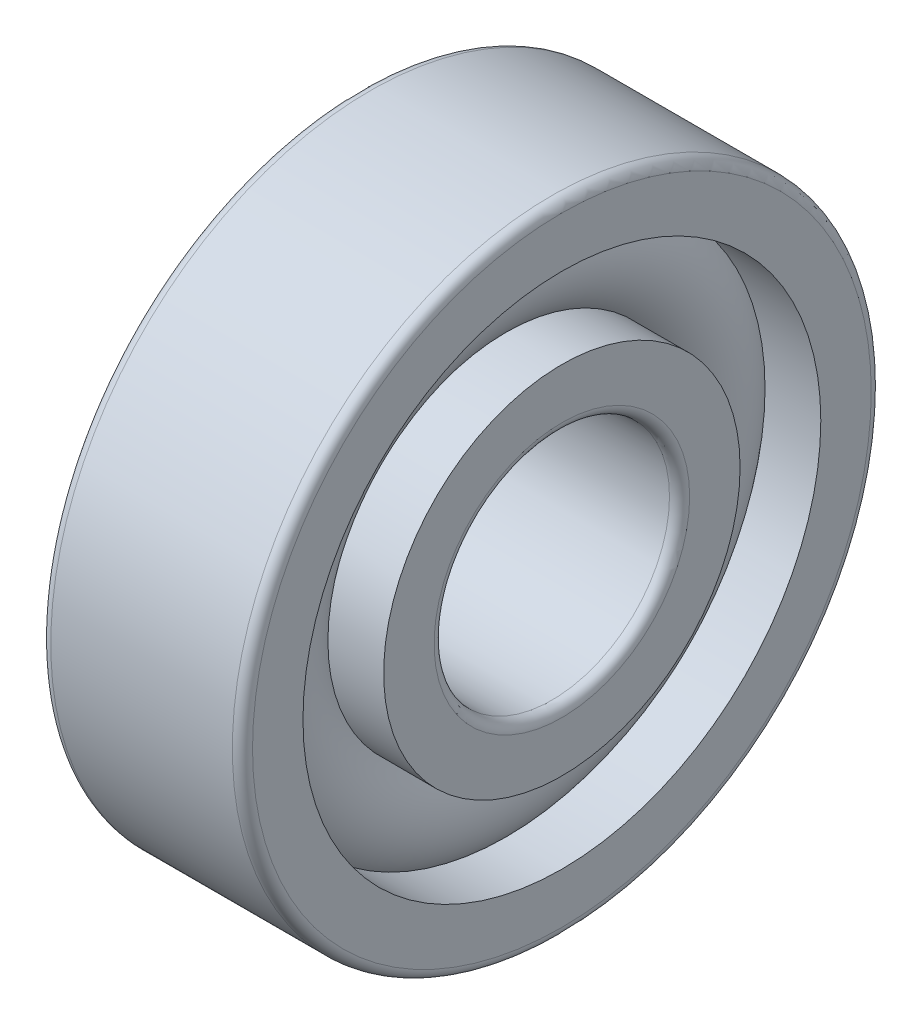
ISO-10303-21;
HEADER;
FILE_DESCRIPTION(('STEP AP214'),'2;1');
FILE_NAME('part.step','',(''),(''),'','','');
FILE_SCHEMA(('AUTOMOTIVE_DESIGN { 1 0 10303 214 1 1 1 1 }'));
ENDSEC;
DATA;
#1=APPLICATION_CONTEXT('core data for automotive mechanical design processes');
#2=APPLICATION_PROTOCOL_DEFINITION('international standard','automotive_design',2000,#1);
#3=PRODUCT_CONTEXT('',#1,'mechanical');
#4=PRODUCT('Part','Part','',(#3));
#5=PRODUCT_RELATED_PRODUCT_CATEGORY('part','',(#4));
#6=PRODUCT_DEFINITION_FORMATION('','',#4);
#7=PRODUCT_DEFINITION_CONTEXT('part definition',#1,'design');
#8=PRODUCT_DEFINITION('design','',#6,#7);
#9=PRODUCT_DEFINITION_SHAPE('','',#8);
#10=(LENGTH_UNIT() NAMED_UNIT(*) SI_UNIT(.MILLI.,.METRE.));
#11=(NAMED_UNIT(*) PLANE_ANGLE_UNIT() SI_UNIT($,.RADIAN.));
#12=(NAMED_UNIT(*) SI_UNIT($,.STERADIAN.) SOLID_ANGLE_UNIT());
#13=UNCERTAINTY_MEASURE_WITH_UNIT(LENGTH_MEASURE(1.E-05),#10,'distance_accuracy_value','');
#14=(GEOMETRIC_REPRESENTATION_CONTEXT(3) GLOBAL_UNCERTAINTY_ASSIGNED_CONTEXT((#13)) GLOBAL_UNIT_ASSIGNED_CONTEXT((#10,
#11,#12)) REPRESENTATION_CONTEXT('',''));
#15=CARTESIAN_POINT('',(0.,0.,0.));
#16=DIRECTION('',(0.,0.,1.));
#17=DIRECTION('',(1.,0.,0.));
#18=AXIS2_PLACEMENT_3D('',#15,#16,#17);
#19=CARTESIAN_POINT('',(0.,0.,0.));
#20=DIRECTION('',(-1.,0.,0.));
#21=DIRECTION('',(0.,0.,1.));
#22=AXIS2_PLACEMENT_3D('',#19,#20,#21);
#23=TOROIDAL_SURFACE('',#22,6.5,1.8);
#24=CARTESIAN_POINT('',(1.34164078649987,0.,0.));
#25=DIRECTION('',(-1.,0.,0.));
#26=DIRECTION('',(0.,0.,1.));
#27=AXIS2_PLACEMENT_3D('',#24,#25,#26);
#28=CIRCLE('',#27,7.70000000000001);
#29=CARTESIAN_POINT('',(1.34164078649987,0.,7.70000000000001));
#30=VERTEX_POINT('',#29);
#31=EDGE_CURVE('E35',#30,#30,#28,.F.);
#32=ORIENTED_EDGE('',*,*,#31,.T.);
#33=EDGE_LOOP('',(#32));
#34=FACE_BOUND('',#33,.T.);
#35=CARTESIAN_POINT('',(1.34164078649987,0.,0.));
#36=DIRECTION('',(-1.,0.,0.));
#37=DIRECTION('',(0.,0.,1.));
#38=AXIS2_PLACEMENT_3D('',#35,#36,#37);
#39=CIRCLE('',#38,5.3);
#40=CARTESIAN_POINT('',(1.34164078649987,0.,5.3));
#41=VERTEX_POINT('',#40);
#42=EDGE_CURVE('E10',#41,#41,#39,.T.);
#43=ORIENTED_EDGE('',*,*,#42,.T.);
#44=EDGE_LOOP('',(#43));
#45=FACE_BOUND('',#44,.T.);
#46=ADVANCED_FACE('F31',(#34,#45),#23,.T.);
#47=CARTESIAN_POINT('',(-20.6375,0.,0.));
#48=DIRECTION('',(1.,0.,0.));
#49=DIRECTION('',(0.,0.,-1.));
#50=AXIS2_PLACEMENT_3D('',#47,#48,#49);
#51=CYLINDRICAL_SURFACE('',#50,5.3);
#52=CARTESIAN_POINT('',(3.,0.,0.));
#53=DIRECTION('',(1.,0.,0.));
#54=DIRECTION('',(0.,0.,-1.));
#55=AXIS2_PLACEMENT_3D('',#52,#53,#54);
#56=CIRCLE('',#55,5.3);
#57=CARTESIAN_POINT('',(3.,0.,-5.3));
#58=VERTEX_POINT('',#57);
#59=EDGE_CURVE('E44',#58,#58,#56,.T.);
#60=ORIENTED_EDGE('',*,*,#59,.F.);
#61=EDGE_LOOP('',(#60));
#62=FACE_BOUND('',#61,.T.);
#63=ORIENTED_EDGE('',*,*,#42,.F.);
#64=EDGE_LOOP('',(#63));
#65=FACE_BOUND('',#64,.T.);
#66=ADVANCED_FACE('F83',(#62,#65),#51,.T.);
#67=CARTESIAN_POINT('',(-20.6375,0.,0.));
#68=DIRECTION('',(1.,0.,0.));
#69=DIRECTION('',(0.,0.,-1.));
#70=AXIS2_PLACEMENT_3D('',#67,#68,#69);
#71=CYLINDRICAL_SURFACE('',#70,5.3);
#72=CARTESIAN_POINT('',(-3.,0.,0.));
#73=DIRECTION('',(1.,0.,0.));
#74=DIRECTION('',(0.,0.,-1.));
#75=AXIS2_PLACEMENT_3D('',#72,#73,#74);
#76=CIRCLE('',#75,5.3);
#77=CARTESIAN_POINT('',(-3.,0.,-5.3));
#78=VERTEX_POINT('',#77);
#79=EDGE_CURVE('E53',#78,#78,#76,.T.);
#80=ORIENTED_EDGE('',*,*,#79,.T.);
#81=EDGE_LOOP('',(#80));
#82=FACE_BOUND('',#81,.T.);
#83=CARTESIAN_POINT('',(-1.34164078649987,0.,0.));
#84=DIRECTION('',(1.,0.,0.));
#85=DIRECTION('',(0.,0.,-1.));
#86=AXIS2_PLACEMENT_3D('',#83,#84,#85);
#87=CIRCLE('',#86,5.3);
#88=CARTESIAN_POINT('',(-1.34164078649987,0.,-5.3));
#89=VERTEX_POINT('',#88);
#90=EDGE_CURVE('E39',#89,#89,#87,.T.);
#91=ORIENTED_EDGE('',*,*,#90,.F.);
#92=EDGE_LOOP('',(#91));
#93=FACE_BOUND('',#92,.T.);
#94=ADVANCED_FACE('F86',(#82,#93),#71,.T.);
#95=CARTESIAN_POINT('',(3.,3.8,0.));
#96=DIRECTION('',(1.,0.,0.));
#97=DIRECTION('',(0.,0.,-1.));
#98=AXIS2_PLACEMENT_3D('',#95,#96,#97);
#99=PLANE('',#98);
#100=ORIENTED_EDGE('',*,*,#59,.T.);
#101=EDGE_LOOP('',(#100));
#102=FACE_BOUND('',#101,.T.);
#103=CARTESIAN_POINT('',(3.,0.,0.));
#104=DIRECTION('',(1.,0.,0.));
#105=DIRECTION('',(0.,0.,-1.));
#106=AXIS2_PLACEMENT_3D('',#103,#104,#105);
#107=CIRCLE('',#106,3.8);
#108=CARTESIAN_POINT('',(3.,0.,-3.8));
#109=VERTEX_POINT('',#108);
#110=EDGE_CURVE('E75',#109,#109,#107,.T.);
#111=ORIENTED_EDGE('',*,*,#110,.F.);
#112=EDGE_LOOP('',(#111));
#113=FACE_BOUND('',#112,.T.);
#114=ADVANCED_FACE('F80',(#102,#113),#99,.T.);
#115=CARTESIAN_POINT('',(2.7,0.,0.));
#116=DIRECTION('',(1.,0.,0.));
#117=DIRECTION('',(0.,0.,-1.));
#118=AXIS2_PLACEMENT_3D('',#115,#116,#117);
#119=TOROIDAL_SURFACE('',#118,3.8,0.3);
#120=ORIENTED_EDGE('',*,*,#110,.T.);
#121=EDGE_LOOP('',(#120));
#122=FACE_BOUND('',#121,.T.);
#123=CARTESIAN_POINT('',(2.7,0.,0.));
#124=DIRECTION('',(1.,0.,0.));
#125=DIRECTION('',(0.,0.,-1.));
#126=AXIS2_PLACEMENT_3D('',#123,#124,#125);
#127=CIRCLE('',#126,3.5);
#128=CARTESIAN_POINT('',(2.7,0.,-3.5));
#129=VERTEX_POINT('',#128);
#130=EDGE_CURVE('E72',#129,#129,#127,.T.);
#131=ORIENTED_EDGE('',*,*,#130,.F.);
#132=EDGE_LOOP('',(#131));
#133=FACE_BOUND('',#132,.T.);
#134=ADVANCED_FACE('F97',(#122,#133),#119,.T.);
#135=CARTESIAN_POINT('',(-20.6375,0.,0.));
#136=DIRECTION('',(1.,0.,0.));
#137=DIRECTION('',(0.,0.,-1.));
#138=AXIS2_PLACEMENT_3D('',#135,#136,#137);
#139=CYLINDRICAL_SURFACE('',#138,3.5);
#140=ORIENTED_EDGE('',*,*,#130,.T.);
#141=EDGE_LOOP('',(#140));
#142=FACE_BOUND('',#141,.T.);
#143=CARTESIAN_POINT('',(-2.7,0.,0.));
#144=DIRECTION('',(1.,0.,0.));
#145=DIRECTION('',(0.,0.,-1.));
#146=AXIS2_PLACEMENT_3D('',#143,#144,#145);
#147=CIRCLE('',#146,3.5);
#148=CARTESIAN_POINT('',(-2.7,0.,-3.5));
#149=VERTEX_POINT('',#148);
#150=EDGE_CURVE('E69',#149,#149,#147,.T.);
#151=ORIENTED_EDGE('',*,*,#150,.F.);
#152=EDGE_LOOP('',(#151));
#153=FACE_BOUND('',#152,.T.);
#154=ADVANCED_FACE('F100',(#142,#153),#139,.F.);
#155=CARTESIAN_POINT('',(-2.7,0.,0.));
#156=DIRECTION('',(1.,0.,0.));
#157=DIRECTION('',(0.,0.,-1.));
#158=AXIS2_PLACEMENT_3D('',#155,#156,#157);
#159=TOROIDAL_SURFACE('',#158,3.8,0.3);
#160=ORIENTED_EDGE('',*,*,#150,.T.);
#161=EDGE_LOOP('',(#160));
#162=FACE_BOUND('',#161,.T.);
#163=CARTESIAN_POINT('',(-3.,0.,0.));
#164=DIRECTION('',(1.,0.,0.));
#165=DIRECTION('',(0.,0.,-1.));
#166=AXIS2_PLACEMENT_3D('',#163,#164,#165);
#167=CIRCLE('',#166,3.8);
#168=CARTESIAN_POINT('',(-3.,0.,-3.8));
#169=VERTEX_POINT('',#168);
#170=EDGE_CURVE('E66',#169,#169,#167,.T.);
#171=ORIENTED_EDGE('',*,*,#170,.F.);
#172=EDGE_LOOP('',(#171));
#173=FACE_BOUND('',#172,.T.);
#174=ADVANCED_FACE('F104',(#162,#173),#159,.T.);
#175=CARTESIAN_POINT('',(-3.,5.3,0.));
#176=DIRECTION('',(-1.,0.,0.));
#177=DIRECTION('',(0.,0.,1.));
#178=AXIS2_PLACEMENT_3D('',#175,#176,#177);
#179=PLANE('',#178);
#180=ORIENTED_EDGE('',*,*,#170,.T.);
#181=EDGE_LOOP('',(#180));
#182=FACE_BOUND('',#181,.T.);
#183=ORIENTED_EDGE('',*,*,#79,.F.);
#184=EDGE_LOOP('',(#183));
#185=FACE_BOUND('',#184,.T.);
#186=ADVANCED_FACE('F108',(#182,#185),#179,.T.);
#187=CARTESIAN_POINT('',(-1.34164078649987,0.,0.));
#188=DIRECTION('',(1.,0.,0.));
#189=DIRECTION('',(0.,0.,-1.));
#190=AXIS2_PLACEMENT_3D('',#187,#188,#189);
#191=CIRCLE('',#190,7.70000000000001);
#192=CARTESIAN_POINT('',(-1.34164078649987,0.,-7.70000000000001));
#193=VERTEX_POINT('',#192);
#194=EDGE_CURVE('E47',#193,#193,#191,.F.);
#195=ORIENTED_EDGE('',*,*,#194,.T.);
#196=EDGE_LOOP('',(#195));
#197=FACE_BOUND('',#196,.T.);
#198=ORIENTED_EDGE('',*,*,#90,.T.);
#199=EDGE_LOOP('',(#198));
#200=FACE_BOUND('',#199,.T.);
#201=ADVANCED_FACE('F33',(#197,#200),#23,.T.);
#202=CARTESIAN_POINT('',(-20.6375,0.,0.));
#203=DIRECTION('',(1.,0.,0.));
#204=DIRECTION('',(0.,0.,-1.));
#205=AXIS2_PLACEMENT_3D('',#202,#203,#204);
#206=CYLINDRICAL_SURFACE('',#205,7.70000000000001);
#207=CARTESIAN_POINT('',(3.,0.,0.));
#208=DIRECTION('',(1.,0.,0.));
#209=DIRECTION('',(0.,0.,-1.));
#210=AXIS2_PLACEMENT_3D('',#207,#208,#209);
#211=CIRCLE('',#210,7.70000000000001);
#212=CARTESIAN_POINT('',(3.,0.,-7.70000000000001));
#213=VERTEX_POINT('',#212);
#214=EDGE_CURVE('E49',#213,#213,#211,.T.);
#215=ORIENTED_EDGE('',*,*,#214,.T.);
#216=EDGE_LOOP('',(#215));
#217=FACE_BOUND('',#216,.T.);
#218=ORIENTED_EDGE('',*,*,#31,.F.);
#219=EDGE_LOOP('',(#218));
#220=FACE_BOUND('',#219,.T.);
#221=ADVANCED_FACE('F113',(#217,#220),#206,.F.);
#222=CARTESIAN_POINT('',(-20.6375,0.,0.));
#223=DIRECTION('',(1.,0.,0.));
#224=DIRECTION('',(0.,0.,-1.));
#225=AXIS2_PLACEMENT_3D('',#222,#223,#224);
#226=CYLINDRICAL_SURFACE('',#225,7.70000000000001);
#227=CARTESIAN_POINT('',(-3.,0.,0.));
#228=DIRECTION('',(1.,0.,0.));
#229=DIRECTION('',(0.,0.,-1.));
#230=AXIS2_PLACEMENT_3D('',#227,#228,#229);
#231=CIRCLE('',#230,7.70000000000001);
#232=CARTESIAN_POINT('',(-3.,0.,-7.70000000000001));
#233=VERTEX_POINT('',#232);
#234=EDGE_CURVE('E144',#233,#233,#231,.T.);
#235=ORIENTED_EDGE('',*,*,#234,.F.);
#236=EDGE_LOOP('',(#235));
#237=FACE_BOUND('',#236,.T.);
#238=ORIENTED_EDGE('',*,*,#194,.F.);
#239=EDGE_LOOP('',(#238));
#240=FACE_BOUND('',#239,.T.);
#241=ADVANCED_FACE('F116',(#237,#240),#226,.F.);
#242=CARTESIAN_POINT('',(3.,9.2,0.));
#243=DIRECTION('',(1.,0.,0.));
#244=DIRECTION('',(0.,0.,-1.));
#245=AXIS2_PLACEMENT_3D('',#242,#243,#244);
#246=PLANE('',#245);
#247=CARTESIAN_POINT('',(3.,0.,0.));
#248=DIRECTION('',(1.,0.,0.));
#249=DIRECTION('',(0.,0.,-1.));
#250=AXIS2_PLACEMENT_3D('',#247,#248,#249);
#251=CIRCLE('',#250,9.2);
#252=CARTESIAN_POINT('',(3.,0.,-9.2));
#253=VERTEX_POINT('',#252);
#254=EDGE_CURVE('E55',#253,#253,#251,.T.);
#255=ORIENTED_EDGE('',*,*,#254,.T.);
#256=EDGE_LOOP('',(#255));
#257=FACE_BOUND('',#256,.T.);
#258=ORIENTED_EDGE('',*,*,#214,.F.);
#259=EDGE_LOOP('',(#258));
#260=FACE_BOUND('',#259,.T.);
#261=ADVANCED_FACE('F117',(#257,#260),#246,.T.);
#262=CARTESIAN_POINT('',(2.7,0.,0.));
#263=DIRECTION('',(1.,0.,0.));
#264=DIRECTION('',(0.,0.,-1.));
#265=AXIS2_PLACEMENT_3D('',#262,#263,#264);
#266=TOROIDAL_SURFACE('',#265,9.2,0.299999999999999);
#267=CARTESIAN_POINT('',(2.7,0.,0.));
#268=DIRECTION('',(1.,0.,0.));
#269=DIRECTION('',(0.,0.,-1.));
#270=AXIS2_PLACEMENT_3D('',#267,#268,#269);
#271=CIRCLE('',#270,9.5);
#272=CARTESIAN_POINT('',(2.7,0.,-9.5));
#273=VERTEX_POINT('',#272);
#274=EDGE_CURVE('E60',#273,#273,#271,.T.);
#275=ORIENTED_EDGE('',*,*,#274,.T.);
#276=EDGE_LOOP('',(#275));
#277=FACE_BOUND('',#276,.T.);
#278=ORIENTED_EDGE('',*,*,#254,.F.);
#279=EDGE_LOOP('',(#278));
#280=FACE_BOUND('',#279,.T.);
#281=ADVANCED_FACE('F120',(#277,#280),#266,.T.);
#282=CARTESIAN_POINT('',(-20.6375,0.,0.));
#283=DIRECTION('',(1.,0.,0.));
#284=DIRECTION('',(0.,0.,-1.));
#285=AXIS2_PLACEMENT_3D('',#282,#283,#284);
#286=CYLINDRICAL_SURFACE('',#285,9.5);
#287=CARTESIAN_POINT('',(-2.7,0.,0.));
#288=DIRECTION('',(1.,0.,0.));
#289=DIRECTION('',(0.,0.,-1.));
#290=AXIS2_PLACEMENT_3D('',#287,#288,#289);
#291=CIRCLE('',#290,9.5);
#292=CARTESIAN_POINT('',(-2.7,0.,-9.5));
#293=VERTEX_POINT('',#292);
#294=EDGE_CURVE('E148',#293,#293,#291,.T.);
#295=ORIENTED_EDGE('',*,*,#294,.T.);
#296=EDGE_LOOP('',(#295));
#297=FACE_BOUND('',#296,.T.);
#298=ORIENTED_EDGE('',*,*,#274,.F.);
#299=EDGE_LOOP('',(#298));
#300=FACE_BOUND('',#299,.T.);
#301=ADVANCED_FACE('F124',(#297,#300),#286,.T.);
#302=CARTESIAN_POINT('',(-2.7,0.,0.));
#303=DIRECTION('',(1.,0.,0.));
#304=DIRECTION('',(0.,0.,-1.));
#305=AXIS2_PLACEMENT_3D('',#302,#303,#304);
#306=TOROIDAL_SURFACE('',#305,9.2,0.299999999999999);
#307=CARTESIAN_POINT('',(-3.,0.,0.));
#308=DIRECTION('',(1.,0.,0.));
#309=DIRECTION('',(0.,0.,-1.));
#310=AXIS2_PLACEMENT_3D('',#307,#308,#309);
#311=CIRCLE('',#310,9.2);
#312=CARTESIAN_POINT('',(-3.,0.,-9.2));
#313=VERTEX_POINT('',#312);
#314=EDGE_CURVE('E145',#313,#313,#311,.T.);
#315=ORIENTED_EDGE('',*,*,#314,.T.);
#316=EDGE_LOOP('',(#315));
#317=FACE_BOUND('',#316,.T.);
#318=ORIENTED_EDGE('',*,*,#294,.F.);
#319=EDGE_LOOP('',(#318));
#320=FACE_BOUND('',#319,.T.);
#321=ADVANCED_FACE('F128',(#317,#320),#306,.T.);
#322=CARTESIAN_POINT('',(-3.,7.70000000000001,0.));
#323=DIRECTION('',(-1.,0.,0.));
#324=DIRECTION('',(0.,0.,1.));
#325=AXIS2_PLACEMENT_3D('',#322,#323,#324);
#326=PLANE('',#325);
#327=ORIENTED_EDGE('',*,*,#234,.T.);
#328=EDGE_LOOP('',(#327));
#329=FACE_BOUND('',#328,.T.);
#330=ORIENTED_EDGE('',*,*,#314,.F.);
#331=EDGE_LOOP('',(#330));
#332=FACE_BOUND('',#331,.T.);
#333=ADVANCED_FACE('F132',(#329,#332),#326,.T.);
#334=CLOSED_SHELL('',(#46,#66,#94,#114,#134,#154,#174,#186,#201,#221,#241,#261,#281,#301,#321,#333));
#335=MANIFOLD_SOLID_BREP('B2',#334);
#336=ADVANCED_BREP_SHAPE_REPRESENTATION('',(#18,#335),#14);
#337=SHAPE_DEFINITION_REPRESENTATION(#9,#336);
ENDSEC;
END-ISO-10303-21;
